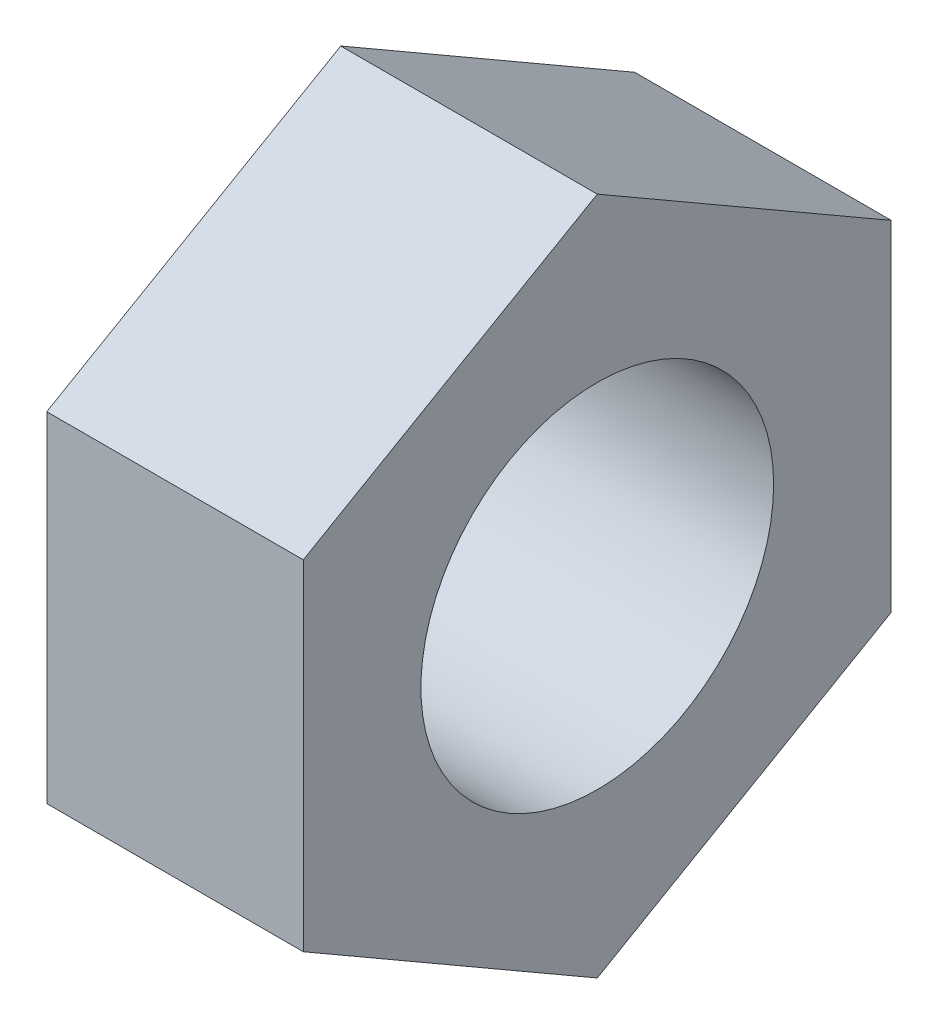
ISO-10303-21;
HEADER;
FILE_DESCRIPTION(('STEP AP214'),'2;1');
FILE_NAME('part.step','',(''),(''),'','','');
FILE_SCHEMA(('AUTOMOTIVE_DESIGN { 1 0 10303 214 1 1 1 1 }'));
ENDSEC;
DATA;
#1=APPLICATION_CONTEXT('core data for automotive mechanical design processes');
#2=APPLICATION_PROTOCOL_DEFINITION('international standard','automotive_design',2000,#1);
#3=PRODUCT_CONTEXT('',#1,'mechanical');
#4=PRODUCT('Part','Part','',(#3));
#5=PRODUCT_RELATED_PRODUCT_CATEGORY('part','',(#4));
#6=PRODUCT_DEFINITION_FORMATION('','',#4);
#7=PRODUCT_DEFINITION_CONTEXT('part definition',#1,'design');
#8=PRODUCT_DEFINITION('design','',#6,#7);
#9=PRODUCT_DEFINITION_SHAPE('','',#8);
#10=(LENGTH_UNIT() NAMED_UNIT(*) SI_UNIT(.MILLI.,.METRE.));
#11=(NAMED_UNIT(*) PLANE_ANGLE_UNIT() SI_UNIT($,.RADIAN.));
#12=(NAMED_UNIT(*) SI_UNIT($,.STERADIAN.) SOLID_ANGLE_UNIT());
#13=UNCERTAINTY_MEASURE_WITH_UNIT(LENGTH_MEASURE(1.E-05),#10,'distance_accuracy_value','');
#14=(GEOMETRIC_REPRESENTATION_CONTEXT(3) GLOBAL_UNCERTAINTY_ASSIGNED_CONTEXT((#13)) GLOBAL_UNIT_ASSIGNED_CONTEXT((#10,
#11,#12)) REPRESENTATION_CONTEXT('',''));
#15=CARTESIAN_POINT('',(0.,0.,0.));
#16=DIRECTION('',(0.,0.,1.));
#17=DIRECTION('',(1.,0.,0.));
#18=AXIS2_PLACEMENT_3D('',#15,#16,#17);
#19=CARTESIAN_POINT('',(13.3,44.,-57.2));
#20=DIRECTION('',(1.,0.,0.));
#21=DIRECTION('',(0.,0.,-1.));
#22=AXIS2_PLACEMENT_3D('',#19,#20,#21);
#23=PLANE('',#22);
#24=CARTESIAN_POINT('',(13.3,44.,-57.2));
#25=DIRECTION('',(1.,0.,0.));
#26=DIRECTION('',(0.,0.,-1.));
#27=AXIS2_PLACEMENT_3D('',#24,#25,#26);
#28=CIRCLE('',#27,1.65);
#29=CARTESIAN_POINT('',(13.3,44.,-58.85));
#30=VERTEX_POINT('',#29);
#31=EDGE_CURVE('E84',#30,#30,#28,.T.);
#32=ORIENTED_EDGE('',*,*,#31,.F.);
#33=EDGE_LOOP('',(#32));
#34=FACE_BOUND('',#33,.T.);
#35=DIRECTION('',(0.,-0.5,-0.866025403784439));
#36=VECTOR('',#35,1.);
#37=CARTESIAN_POINT('',(13.3,41.6184301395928,-55.825));
#38=LINE('',#37,#36);
#39=CARTESIAN_POINT('',(13.3,42.4122867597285,-54.45));
#40=VERTEX_POINT('',#39);
#41=CARTESIAN_POINT('',(13.3,40.8245735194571,-57.2));
#42=VERTEX_POINT('',#41);
#43=EDGE_CURVE('E90',#40,#42,#38,.T.);
#44=ORIENTED_EDGE('',*,*,#43,.T.);
#45=DIRECTION('',(0.,0.5,-0.866025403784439));
#46=VECTOR('',#45,1.);
#47=CARTESIAN_POINT('',(13.3,41.6184301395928,-58.575));
#48=LINE('',#47,#46);
#49=CARTESIAN_POINT('',(13.3,42.4122867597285,-59.95));
#50=VERTEX_POINT('',#49);
#51=EDGE_CURVE('E33',#42,#50,#48,.T.);
#52=ORIENTED_EDGE('',*,*,#51,.T.);
#53=DIRECTION('',(0.,1.,0.));
#54=VECTOR('',#53,1.);
#55=CARTESIAN_POINT('',(13.3,44.,-59.95));
#56=LINE('',#55,#54);
#57=CARTESIAN_POINT('',(13.3,45.5877132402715,-59.95));
#58=VERTEX_POINT('',#57);
#59=EDGE_CURVE('E97',#50,#58,#56,.T.);
#60=ORIENTED_EDGE('',*,*,#59,.T.);
#61=DIRECTION('',(0.,0.5,0.866025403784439));
#62=VECTOR('',#61,1.);
#63=CARTESIAN_POINT('',(13.3,46.3815698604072,-58.575));
#64=LINE('',#63,#62);
#65=CARTESIAN_POINT('',(13.3,47.1754264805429,-57.2));
#66=VERTEX_POINT('',#65);
#67=EDGE_CURVE('E86',#58,#66,#64,.T.);
#68=ORIENTED_EDGE('',*,*,#67,.T.);
#69=DIRECTION('',(0.,-0.5,0.866025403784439));
#70=VECTOR('',#69,1.);
#71=CARTESIAN_POINT('',(13.3,46.3815698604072,-55.825));
#72=LINE('',#71,#70);
#73=CARTESIAN_POINT('',(13.3,45.5877132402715,-54.45));
#74=VERTEX_POINT('',#73);
#75=EDGE_CURVE('E36',#66,#74,#72,.T.);
#76=ORIENTED_EDGE('',*,*,#75,.T.);
#77=DIRECTION('',(0.,-1.,0.));
#78=VECTOR('',#77,1.);
#79=CARTESIAN_POINT('',(13.3,44.,-54.45));
#80=LINE('',#79,#78);
#81=EDGE_CURVE('E105',#74,#40,#80,.T.);
#82=ORIENTED_EDGE('',*,*,#81,.T.);
#83=EDGE_LOOP('',(#44,#52,#60,#68,#76,#82));
#84=FACE_BOUND('',#83,.T.);
#85=ADVANCED_FACE('F16',(#34,#84),#23,.T.);
#86=CARTESIAN_POINT('',(10.9,44.,-57.2));
#87=DIRECTION('',(-1.,0.,0.));
#88=DIRECTION('',(0.,0.,1.));
#89=AXIS2_PLACEMENT_3D('',#86,#87,#88);
#90=PLANE('',#89);
#91=CARTESIAN_POINT('',(10.9,44.,-57.2));
#92=DIRECTION('',(-1.,0.,0.));
#93=DIRECTION('',(0.,0.,1.));
#94=AXIS2_PLACEMENT_3D('',#91,#92,#93);
#95=CIRCLE('',#94,1.65);
#96=CARTESIAN_POINT('',(10.9,44.,-55.55));
#97=VERTEX_POINT('',#96);
#98=EDGE_CURVE('E19',#97,#97,#95,.T.);
#99=ORIENTED_EDGE('',*,*,#98,.F.);
#100=EDGE_LOOP('',(#99));
#101=FACE_BOUND('',#100,.T.);
#102=DIRECTION('',(0.,-1.,0.));
#103=VECTOR('',#102,1.);
#104=CARTESIAN_POINT('',(10.9,44.,-59.95));
#105=LINE('',#104,#103);
#106=CARTESIAN_POINT('',(10.9,45.5877132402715,-59.95));
#107=VERTEX_POINT('',#106);
#108=CARTESIAN_POINT('',(10.9,42.4122867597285,-59.95));
#109=VERTEX_POINT('',#108);
#110=EDGE_CURVE('E93',#107,#109,#105,.T.);
#111=ORIENTED_EDGE('',*,*,#110,.T.);
#112=DIRECTION('',(0.,-0.5,0.866025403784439));
#113=VECTOR('',#112,1.);
#114=CARTESIAN_POINT('',(10.9,41.6184301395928,-58.575));
#115=LINE('',#114,#113);
#116=CARTESIAN_POINT('',(10.9,40.8245735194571,-57.2));
#117=VERTEX_POINT('',#116);
#118=EDGE_CURVE('E114',#109,#117,#115,.T.);
#119=ORIENTED_EDGE('',*,*,#118,.T.);
#120=DIRECTION('',(0.,0.5,0.866025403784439));
#121=VECTOR('',#120,1.);
#122=CARTESIAN_POINT('',(10.9,41.6184301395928,-55.825));
#123=LINE('',#122,#121);
#124=CARTESIAN_POINT('',(10.9,42.4122867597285,-54.45));
#125=VERTEX_POINT('',#124);
#126=EDGE_CURVE('E94',#117,#125,#123,.T.);
#127=ORIENTED_EDGE('',*,*,#126,.T.);
#128=DIRECTION('',(0.,1.,0.));
#129=VECTOR('',#128,1.);
#130=CARTESIAN_POINT('',(10.9,44.,-54.45));
#131=LINE('',#130,#129);
#132=CARTESIAN_POINT('',(10.9,45.5877132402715,-54.45));
#133=VERTEX_POINT('',#132);
#134=EDGE_CURVE('E85',#125,#133,#131,.T.);
#135=ORIENTED_EDGE('',*,*,#134,.T.);
#136=DIRECTION('',(0.,0.5,-0.866025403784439));
#137=VECTOR('',#136,1.);
#138=CARTESIAN_POINT('',(10.9,46.3815698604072,-55.825));
#139=LINE('',#138,#137);
#140=CARTESIAN_POINT('',(10.9,47.1754264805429,-57.2));
#141=VERTEX_POINT('',#140);
#142=EDGE_CURVE('E70',#133,#141,#139,.T.);
#143=ORIENTED_EDGE('',*,*,#142,.T.);
#144=DIRECTION('',(0.,-0.5,-0.866025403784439));
#145=VECTOR('',#144,1.);
#146=CARTESIAN_POINT('',(10.9,46.3815698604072,-58.575));
#147=LINE('',#146,#145);
#148=EDGE_CURVE('E78',#141,#107,#147,.T.);
#149=ORIENTED_EDGE('',*,*,#148,.T.);
#150=EDGE_LOOP('',(#111,#119,#127,#135,#143,#149));
#151=FACE_BOUND('',#150,.T.);
#152=ADVANCED_FACE('F77',(#101,#151),#90,.T.);
#153=CARTESIAN_POINT('',(12.1,44.,-59.95));
#154=DIRECTION('',(0.,0.,-1.));
#155=DIRECTION('',(-1.,0.,0.));
#156=AXIS2_PLACEMENT_3D('',#153,#154,#155);
#157=PLANE('',#156);
#158=ORIENTED_EDGE('',*,*,#59,.F.);
#159=DIRECTION('',(-1.,0.,0.));
#160=VECTOR('',#159,1.);
#161=CARTESIAN_POINT('',(12.1,42.4122867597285,-59.95));
#162=LINE('',#161,#160);
#163=EDGE_CURVE('E112',#50,#109,#162,.T.);
#164=ORIENTED_EDGE('',*,*,#163,.T.);
#165=ORIENTED_EDGE('',*,*,#110,.F.);
#166=DIRECTION('',(1.,0.,0.));
#167=VECTOR('',#166,1.);
#168=CARTESIAN_POINT('',(12.1,45.5877132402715,-59.95));
#169=LINE('',#168,#167);
#170=EDGE_CURVE('E73',#107,#58,#169,.T.);
#171=ORIENTED_EDGE('',*,*,#170,.T.);
#172=EDGE_LOOP('',(#158,#164,#165,#171));
#173=FACE_BOUND('',#172,.T.);
#174=ADVANCED_FACE('F108',(#173),#157,.T.);
#175=CARTESIAN_POINT('',(12.1,44.,-54.45));
#176=DIRECTION('',(0.,0.,1.));
#177=DIRECTION('',(1.,0.,0.));
#178=AXIS2_PLACEMENT_3D('',#175,#176,#177);
#179=PLANE('',#178);
#180=ORIENTED_EDGE('',*,*,#81,.F.);
#181=DIRECTION('',(-1.,0.,0.));
#182=VECTOR('',#181,1.);
#183=CARTESIAN_POINT('',(12.1,45.5877132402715,-54.45));
#184=LINE('',#183,#182);
#185=EDGE_CURVE('E116',#74,#133,#184,.T.);
#186=ORIENTED_EDGE('',*,*,#185,.T.);
#187=ORIENTED_EDGE('',*,*,#134,.F.);
#188=DIRECTION('',(1.,0.,0.));
#189=VECTOR('',#188,1.);
#190=CARTESIAN_POINT('',(12.1,42.4122867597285,-54.45));
#191=LINE('',#190,#189);
#192=EDGE_CURVE('E102',#125,#40,#191,.T.);
#193=ORIENTED_EDGE('',*,*,#192,.T.);
#194=EDGE_LOOP('',(#180,#186,#187,#193));
#195=FACE_BOUND('',#194,.T.);
#196=ADVANCED_FACE('F138',(#195),#179,.T.);
#197=CARTESIAN_POINT('',(12.1,41.6184301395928,-55.825));
#198=DIRECTION('',(0.,-0.866025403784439,0.5));
#199=DIRECTION('',(1.,0.,0.));
#200=AXIS2_PLACEMENT_3D('',#197,#198,#199);
#201=PLANE('',#200);
#202=ORIENTED_EDGE('',*,*,#126,.F.);
#203=DIRECTION('',(1.,0.,0.));
#204=VECTOR('',#203,1.);
#205=CARTESIAN_POINT('',(12.1,40.8245735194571,-57.2));
#206=LINE('',#205,#204);
#207=EDGE_CURVE('E10',#117,#42,#206,.T.);
#208=ORIENTED_EDGE('',*,*,#207,.T.);
#209=ORIENTED_EDGE('',*,*,#43,.F.);
#210=ORIENTED_EDGE('',*,*,#192,.F.);
#211=EDGE_LOOP('',(#202,#208,#209,#210));
#212=FACE_BOUND('',#211,.T.);
#213=ADVANCED_FACE('F118',(#212),#201,.T.);
#214=CARTESIAN_POINT('',(12.1,46.3815698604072,-58.575));
#215=DIRECTION('',(0.,0.866025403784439,-0.5));
#216=DIRECTION('',(-1.,0.,0.));
#217=AXIS2_PLACEMENT_3D('',#214,#215,#216);
#218=PLANE('',#217);
#219=ORIENTED_EDGE('',*,*,#148,.F.);
#220=DIRECTION('',(1.,0.,0.));
#221=VECTOR('',#220,1.);
#222=CARTESIAN_POINT('',(12.1,47.1754264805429,-57.2));
#223=LINE('',#222,#221);
#224=EDGE_CURVE('E24',#141,#66,#223,.T.);
#225=ORIENTED_EDGE('',*,*,#224,.T.);
#226=ORIENTED_EDGE('',*,*,#67,.F.);
#227=ORIENTED_EDGE('',*,*,#170,.F.);
#228=EDGE_LOOP('',(#219,#225,#226,#227));
#229=FACE_BOUND('',#228,.T.);
#230=ADVANCED_FACE('F83',(#229),#218,.T.);
#231=CARTESIAN_POINT('',(12.1,46.3815698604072,-55.825));
#232=DIRECTION('',(0.,0.866025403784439,0.5));
#233=DIRECTION('',(-1.,0.,0.));
#234=AXIS2_PLACEMENT_3D('',#231,#232,#233);
#235=PLANE('',#234);
#236=ORIENTED_EDGE('',*,*,#185,.F.);
#237=ORIENTED_EDGE('',*,*,#75,.F.);
#238=ORIENTED_EDGE('',*,*,#224,.F.);
#239=ORIENTED_EDGE('',*,*,#142,.F.);
#240=EDGE_LOOP('',(#236,#237,#238,#239));
#241=FACE_BOUND('',#240,.T.);
#242=ADVANCED_FACE('F66',(#241),#235,.T.);
#243=CARTESIAN_POINT('',(12.1,41.6184301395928,-58.575));
#244=DIRECTION('',(0.,-0.866025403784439,-0.5));
#245=DIRECTION('',(1.,0.,0.));
#246=AXIS2_PLACEMENT_3D('',#243,#244,#245);
#247=PLANE('',#246);
#248=ORIENTED_EDGE('',*,*,#163,.F.);
#249=ORIENTED_EDGE('',*,*,#51,.F.);
#250=ORIENTED_EDGE('',*,*,#207,.F.);
#251=ORIENTED_EDGE('',*,*,#118,.F.);
#252=EDGE_LOOP('',(#248,#249,#250,#251));
#253=FACE_BOUND('',#252,.T.);
#254=ADVANCED_FACE('F151',(#253),#247,.T.);
#255=CARTESIAN_POINT('',(10.8,44.,-57.2));
#256=DIRECTION('',(1.,0.,0.));
#257=DIRECTION('',(0.,0.,-1.));
#258=AXIS2_PLACEMENT_3D('',#255,#256,#257);
#259=CYLINDRICAL_SURFACE('',#258,1.65);
#260=ORIENTED_EDGE('',*,*,#31,.T.);
#261=EDGE_LOOP('',(#260));
#262=FACE_BOUND('',#261,.T.);
#263=ORIENTED_EDGE('',*,*,#98,.T.);
#264=EDGE_LOOP('',(#263));
#265=FACE_BOUND('',#264,.T.);
#266=ADVANCED_FACE('F135',(#262,#265),#259,.F.);
#267=CLOSED_SHELL('',(#85,#152,#174,#196,#213,#230,#242,#254,#266));
#268=MANIFOLD_SOLID_BREP('B1',#267);
#269=ADVANCED_BREP_SHAPE_REPRESENTATION('',(#18,#268),#14);
#270=SHAPE_DEFINITION_REPRESENTATION(#9,#269);
ENDSEC;
END-ISO-10303-21;
